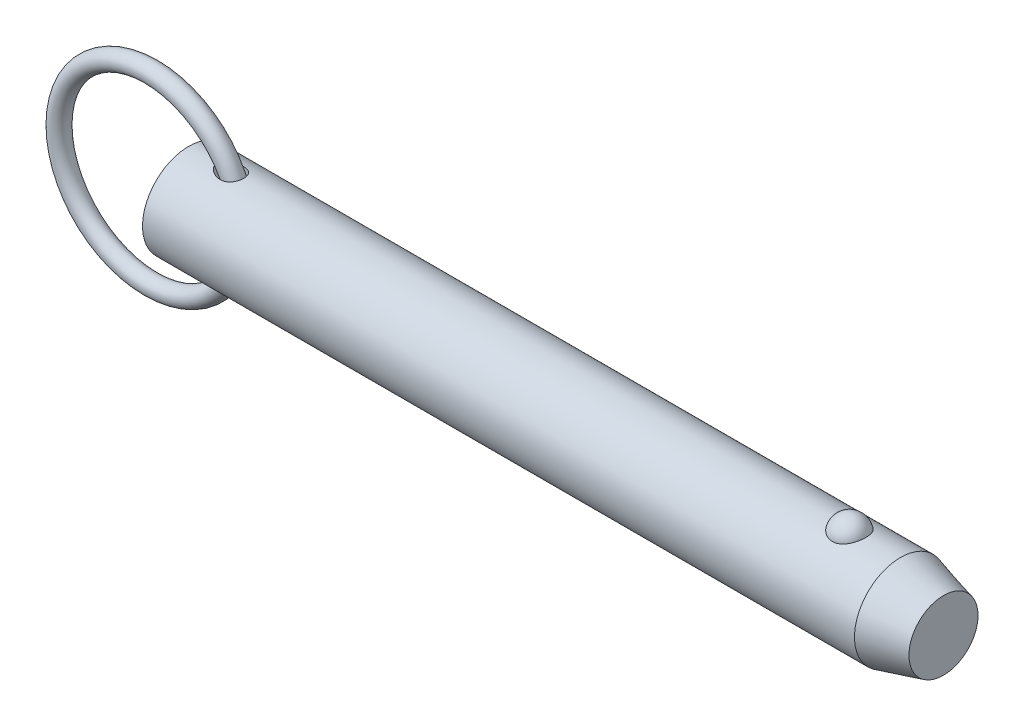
ISO-10303-21;
HEADER;
FILE_DESCRIPTION(('STEP AP214'),'2;1');
FILE_NAME('part.step','',(''),(''),'','','');
FILE_SCHEMA(('AUTOMOTIVE_DESIGN { 1 0 10303 214 1 1 1 1 }'));
ENDSEC;
DATA;
#1=APPLICATION_CONTEXT('core data for automotive mechanical design processes');
#2=APPLICATION_PROTOCOL_DEFINITION('international standard','automotive_design',2000,#1);
#3=PRODUCT_CONTEXT('',#1,'mechanical');
#4=PRODUCT('Part','Part','',(#3));
#5=PRODUCT_RELATED_PRODUCT_CATEGORY('part','',(#4));
#6=PRODUCT_DEFINITION_FORMATION('','',#4);
#7=PRODUCT_DEFINITION_CONTEXT('part definition',#1,'design');
#8=PRODUCT_DEFINITION('design','',#6,#7);
#9=PRODUCT_DEFINITION_SHAPE('','',#8);
#10=(LENGTH_UNIT() NAMED_UNIT(*) SI_UNIT(.MILLI.,.METRE.));
#11=(NAMED_UNIT(*) PLANE_ANGLE_UNIT() SI_UNIT($,.RADIAN.));
#12=(NAMED_UNIT(*) SI_UNIT($,.STERADIAN.) SOLID_ANGLE_UNIT());
#13=UNCERTAINTY_MEASURE_WITH_UNIT(LENGTH_MEASURE(1.E-05),#10,'distance_accuracy_value','');
#14=(GEOMETRIC_REPRESENTATION_CONTEXT(3) GLOBAL_UNCERTAINTY_ASSIGNED_CONTEXT((#13)) GLOBAL_UNIT_ASSIGNED_CONTEXT((#10,
#11,#12)) REPRESENTATION_CONTEXT('',''));
#15=CARTESIAN_POINT('',(0.,0.,0.));
#16=DIRECTION('',(0.,0.,1.));
#17=DIRECTION('',(1.,0.,0.));
#18=AXIS2_PLACEMENT_3D('',#15,#16,#17);
#19=CARTESIAN_POINT('',(-6.46799987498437,0.,0.));
#20=DIRECTION('',(0.,0.,1.));
#21=DIRECTION('',(1.,0.,0.));
#22=AXIS2_PLACEMENT_3D('',#19,#20,#21);
#23=TOROIDAL_SURFACE('',#22,15.875,1.588);
#24=CARTESIAN_POINT('',(10.9950001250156,0.,0.));
#25=VERTEX_POINT('',#24);
#26=VERTEX_LOOP('',#25);
#27=FACE_BOUND('',#26,.T.);
#28=ADVANCED_FACE('P0_F12',(#27),#23,.T.);
#29=CLOSED_SHELL('',(#28));
#30=MANIFOLD_SOLID_BREP('P0_B1',#29);
#31=CARTESIAN_POINT('',(0.,0.,0.));
#32=DIRECTION('',(1.,0.,0.));
#33=DIRECTION('',(0.,0.,-1.));
#34=AXIS2_PLACEMENT_3D('',#31,#32,#33);
#35=CYLINDRICAL_SURFACE('',#34,7.94);
#36=CARTESIAN_POINT('',(5.37881269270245,7.8641200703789,-1.0950869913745));
#37=CARTESIAN_POINT('',(5.49078530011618,7.84653010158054,-1.22142628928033));
#38=CARTESIAN_POINT('',(5.61742164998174,7.82766483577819,-1.33478448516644));
#39=CARTESIAN_POINT('',(5.82155225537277,7.80005811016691,-1.48501770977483));
#40=CARTESIAN_POINT('',(5.89211597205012,7.79095331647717,-1.53186949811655));
#41=CARTESIAN_POINT('',(6.03726296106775,7.77331484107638,-1.61899652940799));
#42=CARTESIAN_POINT('',(6.11184478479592,7.76478095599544,-1.65927412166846));
#43=CARTESIAN_POINT('',(6.31831542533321,7.74290334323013,-1.75933205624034));
#44=CARTESIAN_POINT('',(6.45343253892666,7.73042593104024,-1.81276183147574));
#45=CARTESIAN_POINT('',(6.73017339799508,7.70966096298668,-1.89912673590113));
#46=CARTESIAN_POINT('',(6.8717909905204,7.70136953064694,-1.93208083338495));
#47=CARTESIAN_POINT('',(7.17522096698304,7.6896684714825,-1.97820987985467));
#48=CARTESIAN_POINT('',(7.33750100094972,7.68691980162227,-1.98871513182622));
#49=CARTESIAN_POINT('',(7.5799424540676,7.68880305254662,-1.98137951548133));
#50=CARTESIAN_POINT('',(7.66059155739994,7.69043175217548,-1.97508575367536));
#51=CARTESIAN_POINT('',(7.82077465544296,7.69570110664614,-1.95445819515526));
#52=CARTESIAN_POINT('',(7.9003091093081,7.69934090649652,-1.94012781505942));
#53=CARTESIAN_POINT('',(8.09280087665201,7.71066069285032,-1.89475688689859));
#54=CARTESIAN_POINT('',(8.20465204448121,7.71942251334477,-1.85909462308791));
#55=CARTESIAN_POINT('',(8.42059371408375,7.74035594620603,-1.7699066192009));
#56=CARTESIAN_POINT('',(8.52468939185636,7.75252525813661,-1.7163929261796));
#57=CARTESIAN_POINT('',(8.72211003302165,7.77903750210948,-1.59192358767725));
#58=CARTESIAN_POINT('',(8.81539818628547,7.79338749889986,-1.52091076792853));
#59=CARTESIAN_POINT('',(8.98759177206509,7.8225086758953,-1.36321590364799));
#60=CARTESIAN_POINT('',(9.06649712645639,7.83727985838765,-1.27653377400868));
#61=CARTESIAN_POINT('',(9.20311499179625,7.86453692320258,-1.09567667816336));
#62=CARTESIAN_POINT('',(9.26180839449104,7.8771064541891,-1.00225329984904));
#63=CARTESIAN_POINT('',(9.36257622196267,7.89954213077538,-0.806547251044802));
#64=CARTESIAN_POINT('',(9.40465301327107,7.9094086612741,-0.704265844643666));
#65=CARTESIAN_POINT('',(9.47062404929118,7.92520709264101,-0.49546189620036));
#66=CARTESIAN_POINT('',(9.4947881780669,7.9311972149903,-0.389028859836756));
#67=CARTESIAN_POINT('',(9.52544004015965,7.93883641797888,-0.173494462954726));
#68=CARTESIAN_POINT('',(9.53192786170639,7.94048552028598,-0.0643931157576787));
#69=CARTESIAN_POINT('',(9.52707996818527,7.93926454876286,0.153487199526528));
#70=CARTESIAN_POINT('',(9.51572796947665,7.93639034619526,0.26226578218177));
#71=CARTESIAN_POINT('',(9.47542322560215,7.92642470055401,0.476313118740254));
#72=CARTESIAN_POINT('',(9.44647056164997,7.91933327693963,0.58158188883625));
#73=CARTESIAN_POINT('',(9.37164011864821,7.90170355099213,0.785602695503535));
#74=CARTESIAN_POINT('',(9.32576415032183,7.89116561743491,0.884355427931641));
#75=CARTESIAN_POINT('',(9.21823065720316,7.8677977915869,1.07254831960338));
#76=CARTESIAN_POINT('',(9.15657431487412,7.85496807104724,1.16198917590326));
#77=CARTESIAN_POINT('',(9.01919194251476,7.82843688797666,1.32903649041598));
#78=CARTESIAN_POINT('',(8.94347744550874,7.81473614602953,1.40665255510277));
#79=CARTESIAN_POINT('',(8.78012086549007,7.7879321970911,1.5481977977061));
#80=CARTESIAN_POINT('',(8.69247914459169,7.77482897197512,1.61212739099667));
#81=CARTESIAN_POINT('',(8.50642314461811,7.75037063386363,1.72592270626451));
#82=CARTESIAN_POINT('',(8.40786430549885,7.73904540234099,1.77555777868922));
#83=CARTESIAN_POINT('',(8.2039870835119,7.71943979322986,1.85894844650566));
#84=CARTESIAN_POINT('',(8.0986670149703,7.7111601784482,1.89270006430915));
#85=CARTESIAN_POINT('',(7.87703213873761,7.69782475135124,1.94625652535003));
#86=CARTESIAN_POINT('',(7.76044899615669,7.69301557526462,1.96500324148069));
#87=CARTESIAN_POINT('',(7.52574256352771,7.68770484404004,1.98567257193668));
#88=CARTESIAN_POINT('',(7.40761868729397,7.68720497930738,1.98758858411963));
#89=CARTESIAN_POINT('',(7.15639592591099,7.69044495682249,1.97502233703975));
#90=CARTESIAN_POINT('',(7.02341871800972,7.69476380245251,1.9583009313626));
#91=CARTESIAN_POINT('',(6.76125891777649,7.70776394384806,1.90648094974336));
#92=CARTESIAN_POINT('',(6.6320804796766,7.71644984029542,1.87136299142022));
#93=CARTESIAN_POINT('',(6.35978215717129,7.73875442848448,1.77707737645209));
#94=CARTESIAN_POINT('',(6.2177212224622,7.75293863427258,1.71496895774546));
#95=CARTESIAN_POINT('',(5.94559201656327,7.78383102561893,1.56880760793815));
#96=CARTESIAN_POINT('',(5.81552062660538,7.80053855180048,1.48476040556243));
#97=CARTESIAN_POINT('',(5.60081087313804,7.83035955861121,1.31701356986));
#98=CARTESIAN_POINT('',(5.51265224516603,7.84340226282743,1.23780647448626));
#99=CARTESIAN_POINT('',(5.34976240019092,7.86852524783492,1.06647953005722));
#100=CARTESIAN_POINT('',(5.27500719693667,7.88060722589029,0.974383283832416));
#101=CARTESIAN_POINT('',(5.15877594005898,7.89990441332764,0.800548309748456));
#102=CARTESIAN_POINT('',(5.11360209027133,7.90759876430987,0.721348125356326));
#103=CARTESIAN_POINT('',(5.03655060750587,7.92090267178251,0.55651819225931));
#104=CARTESIAN_POINT('',(5.00466157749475,7.92651401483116,0.470894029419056));
#105=CARTESIAN_POINT('',(4.95653766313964,7.93503671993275,0.294356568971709));
#106=CARTESIAN_POINT('',(4.94043621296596,7.93792505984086,0.203404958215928));
#107=CARTESIAN_POINT('',(4.92605720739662,7.94050250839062,0.0200631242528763));
#108=CARTESIAN_POINT('',(4.92776929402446,7.9401934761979,-0.0723262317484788));
#109=CARTESIAN_POINT('',(4.94742735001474,7.93667454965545,-0.243250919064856));
#110=CARTESIAN_POINT('',(4.96327131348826,7.93384031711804,-0.322048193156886));
#111=CARTESIAN_POINT('',(5.00707570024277,7.92609115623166,-0.476058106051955));
#112=CARTESIAN_POINT('',(5.03503965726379,7.92117562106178,-0.55126969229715));
#113=CARTESIAN_POINT('',(5.10737112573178,7.90866290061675,-0.709995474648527));
#114=CARTESIAN_POINT('',(5.15379379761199,7.90074105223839,-0.792541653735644));
#115=CARTESIAN_POINT('',(5.2582083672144,7.88338732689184,-0.949781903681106));
#116=CARTESIAN_POINT('',(5.31621941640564,7.87395295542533,-1.02446265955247));
#117=CARTESIAN_POINT('',(5.37881269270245,7.8641200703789,-1.0950869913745));
#118=B_SPLINE_CURVE_WITH_KNOTS('',3,(#36,#37,#38,#39,#40,#41,#42,#43,#44,#45,#46,#47,#48,#49,
#50,#51,#52,#53,#54,#55,#56,#57,#58,#59,#60,#61,#62,#63,#64,#65,#66,#67,#68,#69,#70,#71,#72,#73,
#74,#75,#76,#77,#78,#79,#80,#81,#82,#83,#84,#85,#86,#87,#88,#89,#90,#91,#92,#93,#94,#95,#96,#97,
#98,#99,#100,#101,#102,#103,#104,#105,#106,#107,#108,#109,#110,#111,#112,#113,#114,#115,#116,
#117),.UNSPECIFIED.,.T.,.F.,(4,2,2,2,2,2,2,2,2,2,2,2,2,2,2,2,2,2,2,2,2,2,2,2,2,2,2,2,2,2,2,2,2,
2,2,2,2,2,2,2,4),(0.,0.508599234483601,0.763935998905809,1.01918131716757,1.45492798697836,
1.89027038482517,2.37502798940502,2.61739702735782,2.85966310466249,3.21120678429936,
3.56251370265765,3.91498401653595,4.26745624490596,4.59897839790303,4.93045331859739,
5.2568264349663,5.58319792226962,5.909867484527,6.23653553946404,6.56316865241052,
6.88977729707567,7.21611917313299,7.54245114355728,7.87378632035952,8.20520442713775,
8.55832700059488,8.91158808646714,9.31234018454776,9.71351536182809,10.1786231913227,
10.6436096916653,11.0001264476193,11.3559986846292,11.6294791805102,11.9027245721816,
12.1782599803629,12.4536351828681,12.693828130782,12.9340911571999,13.2179277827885,
13.5022374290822),.UNSPECIFIED.);
#119=CARTESIAN_POINT('',(5.37881269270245,7.8641200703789,-1.0950869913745));
#120=VERTEX_POINT('',#119);
#121=EDGE_CURVE('P1_E40',#120,#120,#118,.T.);
#122=ORIENTED_EDGE('',*,*,#121,.T.);
#123=EDGE_LOOP('',(#122));
#124=FACE_BOUND('',#123,.T.);
#125=CARTESIAN_POINT('',(122.771879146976,0.,0.));
#126=DIRECTION('',(1.,0.,0.));
#127=DIRECTION('',(0.,0.,-1.));
#128=AXIS2_PLACEMENT_3D('',#125,#126,#127);
#129=CIRCLE('',#128,7.94);
#130=CARTESIAN_POINT('',(122.771879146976,0.,-7.94));
#131=VERTEX_POINT('',#130);
#132=EDGE_CURVE('P1_E25',#131,#131,#129,.T.);
#133=ORIENTED_EDGE('',*,*,#132,.F.);
#134=EDGE_LOOP('',(#133));
#135=FACE_BOUND('',#134,.T.);
#136=CARTESIAN_POINT('',(0.,0.,0.));
#137=DIRECTION('',(1.,0.,0.));
#138=DIRECTION('',(0.,0.,-1.));
#139=AXIS2_PLACEMENT_3D('',#136,#137,#138);
#140=CIRCLE('',#139,7.94);
#141=CARTESIAN_POINT('',(0.,0.,-7.94));
#142=VERTEX_POINT('',#141);
#143=EDGE_CURVE('P1_E9',#142,#142,#140,.T.);
#144=ORIENTED_EDGE('',*,*,#143,.T.);
#145=EDGE_LOOP('',(#144));
#146=FACE_BOUND('',#145,.T.);
#147=CARTESIAN_POINT('',(113.964907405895,7.37767842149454,2.93486986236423));
#148=CARTESIAN_POINT('',(113.812749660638,7.3776732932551,2.93487505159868));
#149=CARTESIAN_POINT('',(113.660632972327,7.38258419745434,2.92262454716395));
#150=CARTESIAN_POINT('',(113.360928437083,7.40163229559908,2.87404196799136));
#151=CARTESIAN_POINT('',(113.213339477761,7.41576720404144,2.83771585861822));
#152=CARTESIAN_POINT('',(112.927018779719,7.4516157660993,2.74218769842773));
#153=CARTESIAN_POINT('',(112.788274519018,7.47331841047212,2.68301886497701));
#154=CARTESIAN_POINT('',(112.522882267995,7.52194082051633,2.54350967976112));
#155=CARTESIAN_POINT('',(112.396236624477,7.5488615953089,2.46316523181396));
#156=CARTESIAN_POINT('',(112.154534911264,7.60594671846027,2.28090375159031));
#157=CARTESIAN_POINT('',(112.039906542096,7.63618114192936,2.17844211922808));
#158=CARTESIAN_POINT('',(111.828878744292,7.69614046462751,1.95608495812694));
#159=CARTESIAN_POINT('',(111.732482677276,7.72586526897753,1.83618622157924));
#160=CARTESIAN_POINT('',(111.555938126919,7.78314821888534,1.57628086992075));
#161=CARTESIAN_POINT('',(111.476707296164,7.81055035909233,1.43561546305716));
#162=CARTESIAN_POINT('',(111.341797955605,7.85879631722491,1.14236334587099));
#163=CARTESIAN_POINT('',(111.286121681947,7.87963951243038,0.989775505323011));
#164=CARTESIAN_POINT('',(111.19881215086,7.91289645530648,0.674619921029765));
#165=CARTESIAN_POINT('',(111.16753090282,7.925186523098,0.511941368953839));
#166=CARTESIAN_POINT('',(111.130975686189,7.93958930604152,0.183247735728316));
#167=CARTESIAN_POINT('',(111.125701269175,7.94170219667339,0.0172327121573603));
#168=CARTESIAN_POINT('',(111.141231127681,7.93554931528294,-0.312672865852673));
#169=CARTESIAN_POINT('',(111.161925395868,7.92732732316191,-0.476569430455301));
#170=CARTESIAN_POINT('',(111.22878655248,7.90141534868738,-0.798305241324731));
#171=CARTESIAN_POINT('',(111.274953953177,7.88372517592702,-0.956144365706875));
#172=CARTESIAN_POINT('',(111.391898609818,7.84066230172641,-1.26152073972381));
#173=CARTESIAN_POINT('',(111.462704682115,7.81528060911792,-1.40904568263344));
#174=CARTESIAN_POINT('',(111.627478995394,7.7594867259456,-1.68950598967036));
#175=CARTESIAN_POINT('',(111.721448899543,7.72907417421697,-1.82244030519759));
#176=CARTESIAN_POINT('',(111.930839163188,7.66640424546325,-2.07032792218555));
#177=CARTESIAN_POINT('',(112.046315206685,7.63414223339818,-2.1852330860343));
#178=CARTESIAN_POINT('',(112.2959006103,7.57149681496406,-2.39329737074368));
#179=CARTESIAN_POINT('',(112.430008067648,7.54111321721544,-2.48645870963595));
#180=CARTESIAN_POINT('',(112.710111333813,7.48650742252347,-2.64628132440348));
#181=CARTESIAN_POINT('',(112.855760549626,7.46215900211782,-2.71350554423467));
#182=CARTESIAN_POINT('',(113.157425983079,7.42171253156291,-2.82226614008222));
#183=CARTESIAN_POINT('',(113.313438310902,7.40561140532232,-2.86381209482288));
#184=CARTESIAN_POINT('',(113.622970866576,7.3842679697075,-2.9183907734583));
#185=CARTESIAN_POINT('',(113.776222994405,7.37852109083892,-2.93275024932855));
#186=CARTESIAN_POINT('',(114.083070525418,7.37700973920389,-2.93655208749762));
#187=CARTESIAN_POINT('',(114.236665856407,7.38124333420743,-2.92599927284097));
#188=CARTESIAN_POINT('',(114.534990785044,7.39890635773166,-2.88102897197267));
#189=CARTESIAN_POINT('',(114.679848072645,7.41205491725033,-2.8473399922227));
#190=CARTESIAN_POINT('',(114.96164329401,7.445801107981,-2.75788206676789));
#191=CARTESIAN_POINT('',(115.098580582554,7.46639934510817,-2.70211132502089));
#192=CARTESIAN_POINT('',(115.364061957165,7.51339098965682,-2.56858908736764));
#193=CARTESIAN_POINT('',(115.492354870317,7.53990200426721,-2.49038067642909));
#194=CARTESIAN_POINT('',(115.734244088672,7.59569503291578,-2.31462737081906));
#195=CARTESIAN_POINT('',(115.847837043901,7.62497767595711,-2.21707808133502));
#196=CARTESIAN_POINT('',(116.06322156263,7.68489473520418,-1.99982049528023));
#197=CARTESIAN_POINT('',(116.164148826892,7.71552419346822,-1.87925337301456));
#198=CARTESIAN_POINT('',(116.345186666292,7.77353016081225,-1.62268826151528));
#199=CARTESIAN_POINT('',(116.425293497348,7.80090608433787,-1.4866875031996));
#200=CARTESIAN_POINT('',(116.565361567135,7.85047992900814,-1.19818413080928));
#201=CARTESIAN_POINT('',(116.624587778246,7.8724818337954,-1.04529016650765));
#202=CARTESIAN_POINT('',(116.717982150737,7.90785114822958,-0.731080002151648));
#203=CARTESIAN_POINT('',(116.752149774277,7.92121837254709,-0.569763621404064));
#204=CARTESIAN_POINT('',(116.794795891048,7.93797834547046,-0.242812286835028));
#205=CARTESIAN_POINT('',(116.803204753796,7.94134405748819,-0.0771668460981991));
#206=CARTESIAN_POINT('',(116.793962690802,7.93767937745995,0.253276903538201));
#207=CARTESIAN_POINT('',(116.776312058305,7.93064910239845,0.41807522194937));
#208=CARTESIAN_POINT('',(116.715424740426,7.90695571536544,0.741525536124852));
#209=CARTESIAN_POINT('',(116.672281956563,7.8903279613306,0.900197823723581));
#210=CARTESIAN_POINT('',(116.56135358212,7.84916386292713,1.20759654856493));
#211=CARTESIAN_POINT('',(116.49356656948,7.82462706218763,1.35632241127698));
#212=CARTESIAN_POINT('',(116.334371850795,7.7700669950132,1.64032869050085));
#213=CARTESIAN_POINT('',(116.242861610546,7.7400200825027,1.77554712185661));
#214=CARTESIAN_POINT('',(116.038296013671,7.67774175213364,2.02800648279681));
#215=CARTESIAN_POINT('',(115.925241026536,7.64551037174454,2.14524772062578));
#216=CARTESIAN_POINT('',(115.680831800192,7.58265895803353,2.35778002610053));
#217=CARTESIAN_POINT('',(115.549583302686,7.5520309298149,2.45319004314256));
#218=CARTESIAN_POINT('',(115.271601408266,7.49579792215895,2.61999897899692));
#219=CARTESIAN_POINT('',(115.124867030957,7.47019326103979,2.69139637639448));
#220=CARTESIAN_POINT('',(114.812947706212,7.42622216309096,2.8105324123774));
#221=CARTESIAN_POINT('',(114.647220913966,7.40825002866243,2.85700910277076));
#222=CARTESIAN_POINT('',(114.309279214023,7.38398348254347,2.9191685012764));
#223=CARTESIAN_POINT('',(114.13706702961,7.3776842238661,2.93486399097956));
#224=CARTESIAN_POINT('',(113.964907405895,7.37767842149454,2.93486986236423));
#225=B_SPLINE_CURVE_WITH_KNOTS('',3,(#147,#148,#149,#150,#151,#152,#153,#154,#155,#156,#157,
#158,#159,#160,#161,#162,#163,#164,#165,#166,#167,#168,#169,#170,#171,#172,#173,#174,#175,#176,
#177,#178,#179,#180,#181,#182,#183,#184,#185,#186,#187,#188,#189,#190,#191,#192,#193,#194,#195,
#196,#197,#198,#199,#200,#201,#202,#203,#204,#205,#206,#207,#208,#209,#210,#211,#212,#213,#214,
#215,#216,#217,#218,#219,#220,#221,#222,#223,#224),.UNSPECIFIED.,.T.,.F.,(4,2,2,2,2,2,2,2,2,2,2,
2,2,2,2,2,2,2,2,2,2,2,2,2,2,2,2,2,2,2,2,2,2,2,2,2,2,2,4),(0.,0.45584132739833,0.911569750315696,
1.36663794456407,1.8217942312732,2.28978983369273,2.7578716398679,3.246853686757,
3.73588214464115,4.23184282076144,4.72779494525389,5.22165321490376,5.71552141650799,
6.20996917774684,6.70445245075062,7.20023431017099,7.69596557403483,8.18023418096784,
8.66432203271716,9.12410697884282,9.58380291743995,10.0296503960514,10.4755341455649,
10.9312349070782,11.3870393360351,11.8654416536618,12.3439299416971,12.8378875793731,
13.3318558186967,13.8271581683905,14.3224549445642,14.8159385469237,15.3094506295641,
15.8051323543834,16.3008055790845,16.7937101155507,17.2866458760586,17.8026240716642,
18.3183879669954),.UNSPECIFIED.);
#226=CARTESIAN_POINT('',(113.964907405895,7.37767842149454,2.93486986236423));
#227=VERTEX_POINT('',#226);
#228=EDGE_CURVE('P1_E34',#227,#227,#225,.T.);
#229=ORIENTED_EDGE('',*,*,#228,.T.);
#230=EDGE_LOOP('',(#229));
#231=FACE_BOUND('',#230,.T.);
#232=CARTESIAN_POINT('',(5.37881269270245,-7.8641200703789,-1.0950869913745));
#233=CARTESIAN_POINT('',(5.31532711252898,-7.87409326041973,-1.02345575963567));
#234=CARTESIAN_POINT('',(5.25654962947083,-7.88365715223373,-0.947641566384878));
#235=CARTESIAN_POINT('',(5.15093536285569,-7.90122221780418,-0.787865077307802));
#236=CARTESIAN_POINT('',(5.10408931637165,-7.90922460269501,-0.703909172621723));
#237=CARTESIAN_POINT('',(5.02499142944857,-7.92292057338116,-0.527991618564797));
#238=CARTESIAN_POINT('',(4.99290048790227,-7.92858863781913,-0.435954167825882));
#239=CARTESIAN_POINT('',(4.94718343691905,-7.93670712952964,-0.247266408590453));
#240=CARTESIAN_POINT('',(4.93353142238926,-7.93916207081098,-0.150622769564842));
#241=CARTESIAN_POINT('',(4.92669426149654,-7.94038957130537,0.03064599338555));
#242=CARTESIAN_POINT('',(4.9310562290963,-7.93960347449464,0.115182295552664));
#243=CARTESIAN_POINT('',(4.95441758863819,-7.93542535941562,0.282133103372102));
#244=CARTESIAN_POINT('',(4.97342060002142,-7.93203269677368,0.364547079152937));
#245=CARTESIAN_POINT('',(5.02337664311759,-7.92322764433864,0.521528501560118));
#246=CARTESIAN_POINT('',(5.05377582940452,-7.91790920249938,0.596281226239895));
#247=CARTESIAN_POINT('',(5.1246872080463,-7.90571364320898,0.740640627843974));
#248=CARTESIAN_POINT('',(5.16520358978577,-7.89883588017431,0.810245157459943));
#249=CARTESIAN_POINT('',(5.27792634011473,-7.88012470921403,0.978620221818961));
#250=CARTESIAN_POINT('',(5.35563200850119,-7.86757912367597,1.07363778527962));
#251=CARTESIAN_POINT('',(5.52523836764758,-7.84150676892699,1.24994147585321));
#252=CARTESIAN_POINT('',(5.61717506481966,-7.82797755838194,1.33119164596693));
#253=CARTESIAN_POINT('',(5.83913717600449,-7.79742756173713,1.50104748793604));
#254=CARTESIAN_POINT('',(5.9725742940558,-7.78050347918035,1.58521567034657));
#255=CARTESIAN_POINT('',(6.25160600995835,-7.74942135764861,1.73078109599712));
#256=CARTESIAN_POINT('',(6.39720857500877,-7.73526515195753,1.79216327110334));
#257=CARTESIAN_POINT('',(6.69793322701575,-7.7116170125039,1.89134478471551));
#258=CARTESIAN_POINT('',(6.85312134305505,-7.70216275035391,1.92895428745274));
#259=CARTESIAN_POINT('',(7.16781951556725,-7.68988337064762,1.97736316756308));
#260=CARTESIAN_POINT('',(7.32732244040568,-7.68704791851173,1.98820434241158));
#261=CARTESIAN_POINT('',(7.61290770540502,-7.68890797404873,1.98097687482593));
#262=CARTESIAN_POINT('',(7.73913797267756,-7.69217875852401,1.96837928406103));
#263=CARTESIAN_POINT('',(7.98774248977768,-7.70364253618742,1.92303262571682));
#264=CARTESIAN_POINT('',(8.11011880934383,-7.71183283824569,1.89029457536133));
#265=CARTESIAN_POINT('',(8.34766306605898,-7.73253074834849,1.80375920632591));
#266=CARTESIAN_POINT('',(8.46278682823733,-7.74506226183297,1.74984505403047));
#267=CARTESIAN_POINT('',(8.6806268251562,-7.77294147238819,1.62149891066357));
#268=CARTESIAN_POINT('',(8.78334736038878,-7.78828818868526,1.54707406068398));
#269=CARTESIAN_POINT('',(8.96275951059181,-7.81808719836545,1.38814746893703));
#270=CARTESIAN_POINT('',(9.0410292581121,-7.83247448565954,1.30540890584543));
#271=CARTESIAN_POINT('',(9.18176824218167,-7.86008608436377,1.1272733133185));
#272=CARTESIAN_POINT('',(9.24424163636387,-7.87331070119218,1.03187962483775));
#273=CARTESIAN_POINT('',(9.34924815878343,-7.89649032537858,0.835684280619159));
#274=CARTESIAN_POINT('',(9.39252490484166,-7.90656172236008,0.73529314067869));
#275=CARTESIAN_POINT('',(9.46188913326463,-7.92307290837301,0.528458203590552));
#276=CARTESIAN_POINT('',(9.48797767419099,-7.92951292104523,0.422014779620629));
#277=CARTESIAN_POINT('',(9.5222867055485,-7.93804067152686,0.206589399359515));
#278=CARTESIAN_POINT('',(9.53058328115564,-7.94014694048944,0.0976202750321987));
#279=CARTESIAN_POINT('',(9.52935292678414,-7.93983698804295,-0.120212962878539));
#280=CARTESIAN_POINT('',(9.51982577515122,-7.9374207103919,-0.229077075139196));
#281=CARTESIAN_POINT('',(9.48313466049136,-7.92831916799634,-0.443751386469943));
#282=CARTESIAN_POINT('',(9.45594838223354,-7.92162850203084,-0.549557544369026));
#283=CARTESIAN_POINT('',(9.3845465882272,-7.90469917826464,-0.754954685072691));
#284=CARTESIAN_POINT('',(9.34033171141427,-7.89446065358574,-0.854545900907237));
#285=CARTESIAN_POINT('',(9.23602927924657,-7.87157146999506,-1.04456732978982));
#286=CARTESIAN_POINT('',(9.17596171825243,-7.85892385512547,-1.13500888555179));
#287=CARTESIAN_POINT('',(9.04153430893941,-7.83259746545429,-1.30436780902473));
#288=CARTESIAN_POINT('',(8.96717562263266,-7.81891877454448,-1.38328611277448));
#289=CARTESIAN_POINT('',(8.80603455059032,-7.79196869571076,-1.52782923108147));
#290=CARTESIAN_POINT('',(8.71921490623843,-7.77869867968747,-1.59341269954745));
#291=CARTESIAN_POINT('',(8.53589430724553,-7.7539823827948,-1.7096493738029));
#292=CARTESIAN_POINT('',(8.43939269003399,-7.74253622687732,-1.76030155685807));
#293=CARTESIAN_POINT('',(8.23614706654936,-7.72219212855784,-1.84754820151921));
#294=CARTESIAN_POINT('',(8.12916866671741,-7.71339202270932,-1.88361685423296));
#295=CARTESIAN_POINT('',(7.91082287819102,-7.69955300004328,-1.93940887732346));
#296=CARTESIAN_POINT('',(7.79945379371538,-7.69451555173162,-1.95912586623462));
#297=CARTESIAN_POINT('',(7.56409927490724,-7.6881073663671,-1.98413612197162));
#298=CARTESIAN_POINT('',(7.43993744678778,-7.68713944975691,-1.98784574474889));
#299=CARTESIAN_POINT('',(7.19239878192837,-7.68969629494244,-1.97792309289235));
#300=CARTESIAN_POINT('',(7.0690222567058,-7.69322274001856,-1.96428432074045));
#301=CARTESIAN_POINT('',(6.80624991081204,-7.70498367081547,-1.91768089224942));
#302=CARTESIAN_POINT('',(6.667361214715,-7.71386737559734,-1.88203087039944));
#303=CARTESIAN_POINT('',(6.39625444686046,-7.73551250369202,-1.79098714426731));
#304=CARTESIAN_POINT('',(6.26404857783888,-7.74828074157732,-1.73555871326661));
#305=CARTESIAN_POINT('',(6.06559048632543,-7.77003865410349,-1.63446133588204));
#306=CARTESIAN_POINT('',(5.99591479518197,-7.77821880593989,-1.59522999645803));
#307=CARTESIAN_POINT('',(5.86025875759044,-7.79503524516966,-1.51091846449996));
#308=CARTESIAN_POINT('',(5.79427944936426,-7.80367165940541,-1.46583664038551));
#309=CARTESIAN_POINT('',(5.60322733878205,-7.82978128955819,-1.3219827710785));
#310=CARTESIAN_POINT('',(5.48449649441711,-7.84751780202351,-1.21433077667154));
#311=CARTESIAN_POINT('',(5.37881269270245,-7.8641200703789,-1.0950869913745));
#312=B_SPLINE_CURVE_WITH_KNOTS('',3,(#232,#233,#234,#235,#236,#237,#238,#239,#240,#241,#242,
#243,#244,#245,#246,#247,#248,#249,#250,#251,#252,#253,#254,#255,#256,#257,#258,#259,#260,#261,
#262,#263,#264,#265,#266,#267,#268,#269,#270,#271,#272,#273,#274,#275,#276,#277,#278,#279,#280,
#281,#282,#283,#284,#285,#286,#287,#288,#289,#290,#291,#292,#293,#294,#295,#296,#297,#298,#299,
#300,#301,#302,#303,#304,#305,#306,#307,#308,#309,#310,#311),.UNSPECIFIED.,.T.,.F.,(4,2,2,2,2,2,
2,2,2,2,2,2,2,2,2,2,2,2,2,2,2,2,2,2,2,2,2,2,2,2,2,2,2,2,2,2,2,2,2,4),(0.,0.288363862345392,
0.576503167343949,0.867714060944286,1.15851540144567,1.41111828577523,1.66378363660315,
1.90549406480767,2.1473047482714,2.51540453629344,2.88445136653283,3.35805159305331,
3.83196445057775,4.30961543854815,4.78652012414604,5.16565662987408,5.54458592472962,
5.92563591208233,6.30655339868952,6.64920782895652,6.99177197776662,7.31956587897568,
7.64733959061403,7.97370879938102,8.30008206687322,8.62686856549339,8.95364280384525,
9.28000684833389,9.60634436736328,9.93367879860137,10.261035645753,10.59932199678,
10.9377403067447,11.308967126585,11.6803330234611,12.1096921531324,12.5398088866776,
12.7806650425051,13.0215885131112,13.5016249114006),.UNSPECIFIED.);
#313=CARTESIAN_POINT('',(5.37881269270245,-7.8641200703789,-1.0950869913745));
#314=VERTEX_POINT('',#313);
#315=EDGE_CURVE('P1_E17',#314,#314,#312,.T.);
#316=ORIENTED_EDGE('',*,*,#315,.T.);
#317=EDGE_LOOP('',(#316));
#318=FACE_BOUND('',#317,.T.);
#319=ADVANCED_FACE('P1_F13',(#124,#135,#146,#231,#318),#35,.T.);
#320=CARTESIAN_POINT('',(0.,0.,0.));
#321=DIRECTION('',(-1.,0.,0.));
#322=DIRECTION('',(0.,0.,1.));
#323=AXIS2_PLACEMENT_3D('',#320,#321,#322);
#324=PLANE('',#323);
#325=ORIENTED_EDGE('',*,*,#143,.F.);
#326=EDGE_LOOP('',(#325));
#327=FACE_BOUND('',#326,.T.);
#328=ADVANCED_FACE('P1_F15',(#327),#324,.T.);
#329=CARTESIAN_POINT('',(130.18,0.,0.));
#330=DIRECTION('',(-1.,0.,0.));
#331=DIRECTION('',(0.,0.,1.));
#332=AXIS2_PLACEMENT_3D('',#329,#330,#331);
#333=CONICAL_SURFACE('',#332,5.95500000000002,0.26179938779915);
#334=ORIENTED_EDGE('',*,*,#132,.T.);
#335=EDGE_LOOP('',(#334));
#336=FACE_BOUND('',#335,.T.);
#337=CARTESIAN_POINT('',(130.18,0.,0.));
#338=DIRECTION('',(1.,0.,0.));
#339=DIRECTION('',(0.,0.,-1.));
#340=AXIS2_PLACEMENT_3D('',#337,#338,#339);
#341=CIRCLE('',#340,5.95500000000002);
#342=CARTESIAN_POINT('',(130.18,0.,-5.95500000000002));
#343=VERTEX_POINT('',#342);
#344=EDGE_CURVE('P1_E30',#343,#343,#341,.T.);
#345=ORIENTED_EDGE('',*,*,#344,.F.);
#346=EDGE_LOOP('',(#345));
#347=FACE_BOUND('',#346,.T.);
#348=ADVANCED_FACE('P1_F55',(#336,#347),#333,.T.);
#349=CARTESIAN_POINT('',(130.18,5.95500000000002,0.));
#350=DIRECTION('',(1.,0.,0.));
#351=DIRECTION('',(0.,0.,-1.));
#352=AXIS2_PLACEMENT_3D('',#349,#350,#351);
#353=PLANE('',#352);
#354=ORIENTED_EDGE('',*,*,#344,.T.);
#355=EDGE_LOOP('',(#354));
#356=FACE_BOUND('',#355,.T.);
#357=ADVANCED_FACE('P1_F51',(#356),#353,.T.);
#358=CARTESIAN_POINT('',(113.964907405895,7.146,0.));
#359=DIRECTION('',(-1.,0.,0.));
#360=DIRECTION('',(0.,1.,0.));
#361=AXIS2_PLACEMENT_3D('',#358,#359,#360);
#362=SPHERICAL_SURFACE('',#361,2.944);
#363=ORIENTED_EDGE('',*,*,#228,.F.);
#364=EDGE_LOOP('',(#363));
#365=FACE_BOUND('',#364,.T.);
#366=ADVANCED_FACE('P1_F46',(#365),#362,.T.);
#367=CARTESIAN_POINT('',(-6.46799987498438,0.,0.));
#368=DIRECTION('',(0.,0.,1.));
#369=DIRECTION('',(1.,0.,0.));
#370=AXIS2_PLACEMENT_3D('',#367,#368,#369);
#371=TOROIDAL_SURFACE('',#370,15.875,1.985);
#372=ORIENTED_EDGE('',*,*,#315,.F.);
#373=EDGE_LOOP('',(#372));
#374=FACE_BOUND('',#373,.T.);
#375=ORIENTED_EDGE('',*,*,#121,.F.);
#376=EDGE_LOOP('',(#375));
#377=FACE_BOUND('',#376,.T.);
#378=ADVANCED_FACE('P1_F50',(#374,#377),#371,.F.);
#379=CLOSED_SHELL('',(#319,#328,#348,#357,#366,#378));
#380=MANIFOLD_SOLID_BREP('P1_B1',#379);
#381=ADVANCED_BREP_SHAPE_REPRESENTATION('',(#18,#30,#380),#14);
#382=SHAPE_DEFINITION_REPRESENTATION(#9,#381);
ENDSEC;
END-ISO-10303-21;
